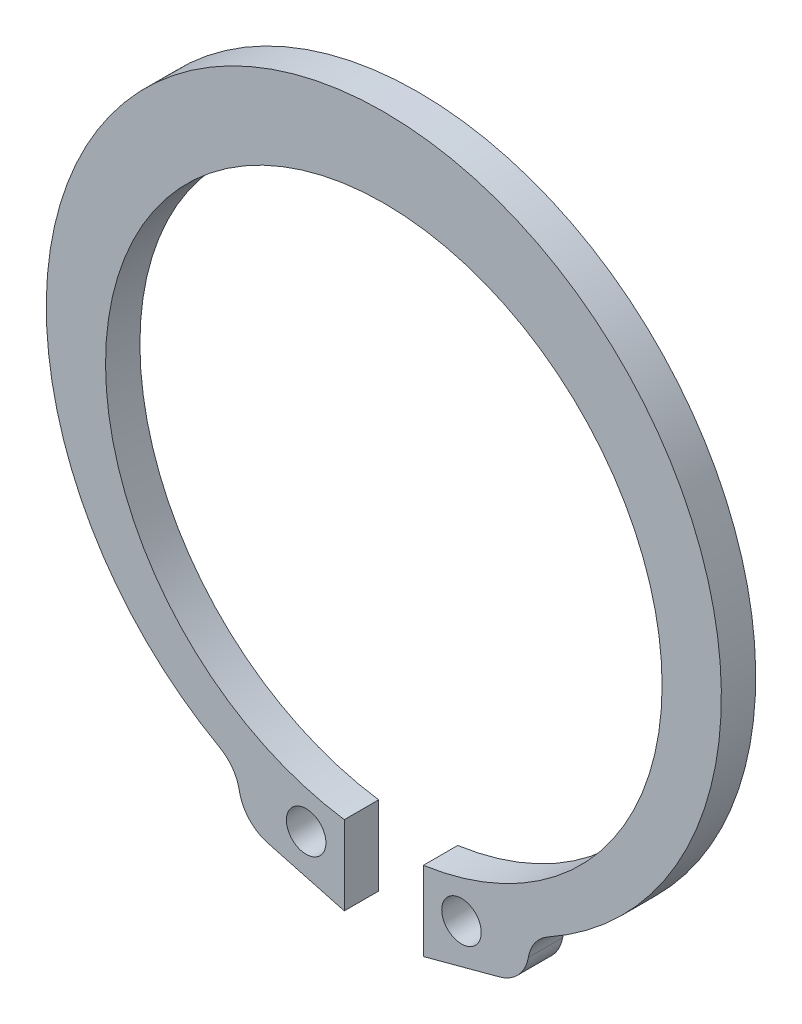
ISO-10303-21;
HEADER;
FILE_DESCRIPTION(('STEP AP214'),'2;1');
FILE_NAME('part.step','',(''),(''),'','','');
FILE_SCHEMA(('AUTOMOTIVE_DESIGN { 1 0 10303 214 1 1 1 1 }'));
ENDSEC;
DATA;
#1=APPLICATION_CONTEXT('core data for automotive mechanical design processes');
#2=APPLICATION_PROTOCOL_DEFINITION('international standard','automotive_design',2000,#1);
#3=PRODUCT_CONTEXT('',#1,'mechanical');
#4=PRODUCT('Part','Part','',(#3));
#5=PRODUCT_RELATED_PRODUCT_CATEGORY('part','',(#4));
#6=PRODUCT_DEFINITION_FORMATION('','',#4);
#7=PRODUCT_DEFINITION_CONTEXT('part definition',#1,'design');
#8=PRODUCT_DEFINITION('design','',#6,#7);
#9=PRODUCT_DEFINITION_SHAPE('','',#8);
#10=(LENGTH_UNIT() NAMED_UNIT(*) SI_UNIT(.MILLI.,.METRE.));
#11=(NAMED_UNIT(*) PLANE_ANGLE_UNIT() SI_UNIT($,.RADIAN.));
#12=(NAMED_UNIT(*) SI_UNIT($,.STERADIAN.) SOLID_ANGLE_UNIT());
#13=UNCERTAINTY_MEASURE_WITH_UNIT(LENGTH_MEASURE(1.E-05),#10,'distance_accuracy_value','');
#14=(GEOMETRIC_REPRESENTATION_CONTEXT(3) GLOBAL_UNCERTAINTY_ASSIGNED_CONTEXT((#13)) GLOBAL_UNIT_ASSIGNED_CONTEXT((#10,
#11,#12)) REPRESENTATION_CONTEXT('',''));
#15=CARTESIAN_POINT('',(0.,0.,0.));
#16=DIRECTION('',(0.,0.,1.));
#17=DIRECTION('',(1.,0.,0.));
#18=AXIS2_PLACEMENT_3D('',#15,#16,#17);
#19=CARTESIAN_POINT('',(-3.07398749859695,-8.61185011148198,1.));
#20=DIRECTION('',(0.,0.,1.));
#21=DIRECTION('',(1.,0.,0.));
#22=AXIS2_PLACEMENT_3D('',#19,#20,#21);
#23=PLANE('',#22);
#24=CARTESIAN_POINT('',(2.26081470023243,-8.87030671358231,1.));
#25=DIRECTION('',(0.,0.,1.));
#26=DIRECTION('',(-1.,0.,0.));
#27=AXIS2_PLACEMENT_3D('',#24,#25,#26);
#28=CIRCLE('',#27,0.575);
#29=CARTESIAN_POINT('',(1.68581470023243,-8.87030671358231,1.));
#30=VERTEX_POINT('',#29);
#31=EDGE_CURVE('E125',#30,#30,#28,.T.);
#32=ORIENTED_EDGE('',*,*,#31,.F.);
#33=EDGE_LOOP('',(#32));
#34=FACE_BOUND('',#33,.T.);
#35=CARTESIAN_POINT('',(-3.07398749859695,-8.61185011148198,1.));
#36=DIRECTION('',(0.,0.,1.));
#37=DIRECTION('',(1.,0.,0.));
#38=AXIS2_PLACEMENT_3D('',#35,#36,#37);
#39=CIRCLE('',#38,1.15);
#40=CARTESIAN_POINT('',(-4.20626452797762,-8.81296880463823,1.));
#41=VERTEX_POINT('',#40);
#42=CARTESIAN_POINT('',(-3.37162940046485,-9.7226648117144,1.));
#43=VERTEX_POINT('',#42);
#44=EDGE_CURVE('E147',#41,#43,#39,.T.);
#45=ORIENTED_EDGE('',*,*,#44,.T.);
#46=DIRECTION('',(0.965925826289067,-0.258819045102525,0.));
#47=VECTOR('',#46,1.);
#48=CARTESIAN_POINT('',(-1.15,-10.3179486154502,1.));
#49=LINE('',#48,#47);
#50=CARTESIAN_POINT('',(-1.15,-10.3179486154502,1.));
#51=VERTEX_POINT('',#50);
#52=EDGE_CURVE('E120',#43,#51,#49,.T.);
#53=ORIENTED_EDGE('',*,*,#52,.T.);
#54=DIRECTION('',(0.,1.,0.));
#55=VECTOR('',#54,1.);
#56=CARTESIAN_POINT('',(-1.15,-8.01794861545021,1.));
#57=LINE('',#56,#55);
#58=CARTESIAN_POINT('',(-1.14999999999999,-8.01794861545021,1.));
#59=VERTEX_POINT('',#58);
#60=EDGE_CURVE('E150',#51,#59,#57,.T.);
#61=ORIENTED_EDGE('',*,*,#60,.T.);
#62=CARTESIAN_POINT('',(0.,0.,1.));
#63=DIRECTION('',(0.,0.,-1.));
#64=DIRECTION('',(1.,0.,0.));
#65=AXIS2_PLACEMENT_3D('',#62,#63,#64);
#66=CIRCLE('',#65,8.1);
#67=CARTESIAN_POINT('',(1.15,-8.01794861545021,1.));
#68=VERTEX_POINT('',#67);
#69=EDGE_CURVE('E152',#59,#68,#66,.T.);
#70=ORIENTED_EDGE('',*,*,#69,.T.);
#71=DIRECTION('',(0.,-1.,0.));
#72=VECTOR('',#71,1.);
#73=CARTESIAN_POINT('',(1.15,-8.01794861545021,1.));
#74=LINE('',#73,#72);
#75=CARTESIAN_POINT('',(1.15,-10.3179486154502,1.));
#76=VERTEX_POINT('',#75);
#77=EDGE_CURVE('E154',#68,#76,#74,.T.);
#78=ORIENTED_EDGE('',*,*,#77,.T.);
#79=DIRECTION('',(0.965925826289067,0.258819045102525,0.));
#80=VECTOR('',#79,1.);
#81=CARTESIAN_POINT('',(1.15,-10.3179486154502,1.));
#82=LINE('',#81,#80);
#83=CARTESIAN_POINT('',(3.37162940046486,-9.7226648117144,1.));
#84=VERTEX_POINT('',#83);
#85=EDGE_CURVE('E156',#76,#84,#82,.T.);
#86=ORIENTED_EDGE('',*,*,#85,.T.);
#87=CARTESIAN_POINT('',(3.07398749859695,-8.61185011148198,1.));
#88=DIRECTION('',(0.,0.,1.));
#89=DIRECTION('',(-1.,0.,0.));
#90=AXIS2_PLACEMENT_3D('',#87,#88,#89);
#91=CIRCLE('',#90,1.15);
#92=CARTESIAN_POINT('',(4.20626452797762,-8.81296880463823,1.));
#93=VERTEX_POINT('',#92);
#94=EDGE_CURVE('E158',#84,#93,#91,.T.);
#95=ORIENTED_EDGE('',*,*,#94,.T.);
#96=CARTESIAN_POINT('',(5.3385415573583,-9.01408749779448,1.));
#97=DIRECTION('',(0.,0.,-1.));
#98=DIRECTION('',(-1.,0.,0.));
#99=AXIS2_PLACEMENT_3D('',#96,#97,#98);
#100=CIRCLE('',#99,1.15);
#101=CARTESIAN_POINT('',(4.77914995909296,-8.00930839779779,1.));
#102=VERTEX_POINT('',#101);
#103=EDGE_CURVE('E160',#93,#102,#100,.T.);
#104=ORIENTED_EDGE('',*,*,#103,.T.);
#105=CARTESIAN_POINT('',(0.,0.575,1.));
#106=DIRECTION('',(0.,0.,1.));
#107=DIRECTION('',(1.,0.,0.));
#108=AXIS2_PLACEMENT_3D('',#105,#106,#107);
#109=CIRCLE('',#108,9.825);
#110=CARTESIAN_POINT('',(-4.77914995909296,-8.00930839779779,1.));
#111=VERTEX_POINT('',#110);
#112=EDGE_CURVE('E49',#102,#111,#109,.T.);
#113=ORIENTED_EDGE('',*,*,#112,.T.);
#114=CARTESIAN_POINT('',(-5.33854155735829,-9.01408749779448,1.));
#115=DIRECTION('',(0.,0.,-1.));
#116=DIRECTION('',(1.,0.,0.));
#117=AXIS2_PLACEMENT_3D('',#114,#115,#116);
#118=CIRCLE('',#117,1.15);
#119=EDGE_CURVE('E44',#111,#41,#118,.T.);
#120=ORIENTED_EDGE('',*,*,#119,.T.);
#121=EDGE_LOOP('',(#45,#53,#61,#70,#78,#86,#95,#104,#113,#120));
#122=FACE_BOUND('',#121,.T.);
#123=CARTESIAN_POINT('',(-2.26081470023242,-8.87030671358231,1.));
#124=DIRECTION('',(0.,0.,1.));
#125=DIRECTION('',(1.,0.,0.));
#126=AXIS2_PLACEMENT_3D('',#123,#124,#125);
#127=CIRCLE('',#126,0.575);
#128=CARTESIAN_POINT('',(-1.68581470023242,-8.87030671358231,1.));
#129=VERTEX_POINT('',#128);
#130=EDGE_CURVE('E247',#129,#129,#127,.T.);
#131=ORIENTED_EDGE('',*,*,#130,.F.);
#132=EDGE_LOOP('',(#131));
#133=FACE_BOUND('',#132,.T.);
#134=ADVANCED_FACE('F29',(#34,#122,#133),#23,.T.);
#135=CARTESIAN_POINT('',(-3.07398749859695,-8.61185011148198,0.));
#136=DIRECTION('',(0.,0.,1.));
#137=DIRECTION('',(1.,0.,0.));
#138=AXIS2_PLACEMENT_3D('',#135,#136,#137);
#139=PLANE('',#138);
#140=CARTESIAN_POINT('',(2.26081470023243,-8.87030671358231,0.));
#141=DIRECTION('',(0.,0.,1.));
#142=DIRECTION('',(-1.,0.,0.));
#143=AXIS2_PLACEMENT_3D('',#140,#141,#142);
#144=CIRCLE('',#143,0.575);
#145=CARTESIAN_POINT('',(1.68581470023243,-8.87030671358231,0.));
#146=VERTEX_POINT('',#145);
#147=EDGE_CURVE('E128',#146,#146,#144,.T.);
#148=ORIENTED_EDGE('',*,*,#147,.T.);
#149=EDGE_LOOP('',(#148));
#150=FACE_BOUND('',#149,.T.);
#151=CARTESIAN_POINT('',(-3.07398749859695,-8.61185011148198,0.));
#152=DIRECTION('',(0.,0.,1.));
#153=DIRECTION('',(1.,0.,0.));
#154=AXIS2_PLACEMENT_3D('',#151,#152,#153);
#155=CIRCLE('',#154,1.15);
#156=CARTESIAN_POINT('',(-4.20626452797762,-8.81296880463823,0.));
#157=VERTEX_POINT('',#156);
#158=CARTESIAN_POINT('',(-3.37162940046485,-9.7226648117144,0.));
#159=VERTEX_POINT('',#158);
#160=EDGE_CURVE('E111',#157,#159,#155,.T.);
#161=ORIENTED_EDGE('',*,*,#160,.F.);
#162=CARTESIAN_POINT('',(-5.33854155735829,-9.01408749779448,0.));
#163=DIRECTION('',(0.,0.,-1.));
#164=DIRECTION('',(1.,0.,0.));
#165=AXIS2_PLACEMENT_3D('',#162,#163,#164);
#166=CIRCLE('',#165,1.15);
#167=CARTESIAN_POINT('',(-4.77914995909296,-8.00930839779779,0.));
#168=VERTEX_POINT('',#167);
#169=EDGE_CURVE('E145',#168,#157,#166,.T.);
#170=ORIENTED_EDGE('',*,*,#169,.F.);
#171=CARTESIAN_POINT('',(0.,0.575,0.));
#172=DIRECTION('',(0.,0.,1.));
#173=DIRECTION('',(1.,0.,0.));
#174=AXIS2_PLACEMENT_3D('',#171,#172,#173);
#175=CIRCLE('',#174,9.825);
#176=CARTESIAN_POINT('',(4.77914995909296,-8.00930839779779,0.));
#177=VERTEX_POINT('',#176);
#178=EDGE_CURVE('E143',#177,#168,#175,.T.);
#179=ORIENTED_EDGE('',*,*,#178,.F.);
#180=CARTESIAN_POINT('',(5.3385415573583,-9.01408749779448,0.));
#181=DIRECTION('',(0.,0.,-1.));
#182=DIRECTION('',(-1.,0.,0.));
#183=AXIS2_PLACEMENT_3D('',#180,#181,#182);
#184=CIRCLE('',#183,1.15);
#185=CARTESIAN_POINT('',(4.20626452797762,-8.81296880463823,0.));
#186=VERTEX_POINT('',#185);
#187=EDGE_CURVE('E141',#186,#177,#184,.T.);
#188=ORIENTED_EDGE('',*,*,#187,.F.);
#189=CARTESIAN_POINT('',(3.07398749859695,-8.61185011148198,0.));
#190=DIRECTION('',(0.,0.,1.));
#191=DIRECTION('',(-1.,0.,0.));
#192=AXIS2_PLACEMENT_3D('',#189,#190,#191);
#193=CIRCLE('',#192,1.15);
#194=CARTESIAN_POINT('',(3.37162940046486,-9.7226648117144,0.));
#195=VERTEX_POINT('',#194);
#196=EDGE_CURVE('E139',#195,#186,#193,.T.);
#197=ORIENTED_EDGE('',*,*,#196,.F.);
#198=DIRECTION('',(0.965925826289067,0.258819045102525,0.));
#199=VECTOR('',#198,1.);
#200=CARTESIAN_POINT('',(1.15,-10.3179486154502,0.));
#201=LINE('',#200,#199);
#202=CARTESIAN_POINT('',(1.15,-10.3179486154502,0.));
#203=VERTEX_POINT('',#202);
#204=EDGE_CURVE('E137',#203,#195,#201,.T.);
#205=ORIENTED_EDGE('',*,*,#204,.F.);
#206=DIRECTION('',(0.,-1.,0.));
#207=VECTOR('',#206,1.);
#208=CARTESIAN_POINT('',(1.15,-8.01794861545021,0.));
#209=LINE('',#208,#207);
#210=CARTESIAN_POINT('',(1.15,-8.01794861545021,0.));
#211=VERTEX_POINT('',#210);
#212=EDGE_CURVE('E135',#211,#203,#209,.T.);
#213=ORIENTED_EDGE('',*,*,#212,.F.);
#214=CARTESIAN_POINT('',(0.,0.,0.));
#215=DIRECTION('',(0.,0.,-1.));
#216=DIRECTION('',(1.,0.,0.));
#217=AXIS2_PLACEMENT_3D('',#214,#215,#216);
#218=CIRCLE('',#217,8.1);
#219=CARTESIAN_POINT('',(-1.14999999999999,-8.01794861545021,0.));
#220=VERTEX_POINT('',#219);
#221=EDGE_CURVE('E133',#220,#211,#218,.T.);
#222=ORIENTED_EDGE('',*,*,#221,.F.);
#223=DIRECTION('',(0.,1.,0.));
#224=VECTOR('',#223,1.);
#225=CARTESIAN_POINT('',(-1.15,-8.01794861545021,0.));
#226=LINE('',#225,#224);
#227=CARTESIAN_POINT('',(-1.15,-10.3179486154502,0.));
#228=VERTEX_POINT('',#227);
#229=EDGE_CURVE('E113',#228,#220,#226,.T.);
#230=ORIENTED_EDGE('',*,*,#229,.F.);
#231=DIRECTION('',(0.965925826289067,-0.258819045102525,0.));
#232=VECTOR('',#231,1.);
#233=CARTESIAN_POINT('',(-1.15,-10.3179486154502,0.));
#234=LINE('',#233,#232);
#235=EDGE_CURVE('E106',#159,#228,#234,.T.);
#236=ORIENTED_EDGE('',*,*,#235,.F.);
#237=EDGE_LOOP('',(#161,#170,#179,#188,#197,#205,#213,#222,#230,#236));
#238=FACE_BOUND('',#237,.T.);
#239=CARTESIAN_POINT('',(-2.26081470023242,-8.87030671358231,0.));
#240=DIRECTION('',(0.,0.,1.));
#241=DIRECTION('',(1.,0.,0.));
#242=AXIS2_PLACEMENT_3D('',#239,#240,#241);
#243=CIRCLE('',#242,0.575);
#244=CARTESIAN_POINT('',(-1.68581470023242,-8.87030671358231,0.));
#245=VERTEX_POINT('',#244);
#246=EDGE_CURVE('E250',#245,#245,#243,.T.);
#247=ORIENTED_EDGE('',*,*,#246,.T.);
#248=EDGE_LOOP('',(#247));
#249=FACE_BOUND('',#248,.T.);
#250=ADVANCED_FACE('F107',(#150,#238,#249),#139,.F.);
#251=CARTESIAN_POINT('',(-3.07398749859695,-8.61185011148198,1.));
#252=DIRECTION('',(0.,0.,-1.));
#253=DIRECTION('',(-1.,0.,0.));
#254=AXIS2_PLACEMENT_3D('',#251,#252,#253);
#255=CYLINDRICAL_SURFACE('',#254,1.15);
#256=ORIENTED_EDGE('',*,*,#160,.T.);
#257=DIRECTION('',(0.,0.,-1.));
#258=VECTOR('',#257,1.);
#259=CARTESIAN_POINT('',(-3.37162940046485,-9.7226648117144,1.));
#260=LINE('',#259,#258);
#261=EDGE_CURVE('E11',#43,#159,#260,.T.);
#262=ORIENTED_EDGE('',*,*,#261,.F.);
#263=ORIENTED_EDGE('',*,*,#44,.F.);
#264=DIRECTION('',(0.,0.,-1.));
#265=VECTOR('',#264,1.);
#266=CARTESIAN_POINT('',(-4.20626452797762,-8.81296880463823,1.));
#267=LINE('',#266,#265);
#268=EDGE_CURVE('E124',#41,#157,#267,.T.);
#269=ORIENTED_EDGE('',*,*,#268,.T.);
#270=EDGE_LOOP('',(#256,#262,#263,#269));
#271=FACE_BOUND('',#270,.T.);
#272=ADVANCED_FACE('F31',(#271),#255,.T.);
#273=CARTESIAN_POINT('',(-1.15,-10.3179486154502,1.));
#274=DIRECTION('',(0.258819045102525,0.965925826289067,0.));
#275=DIRECTION('',(-0.965925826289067,0.258819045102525,0.));
#276=AXIS2_PLACEMENT_3D('',#273,#274,#275);
#277=PLANE('',#276);
#278=ORIENTED_EDGE('',*,*,#235,.T.);
#279=DIRECTION('',(0.,0.,-1.));
#280=VECTOR('',#279,1.);
#281=CARTESIAN_POINT('',(-1.15,-10.3179486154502,1.));
#282=LINE('',#281,#280);
#283=EDGE_CURVE('E37',#51,#228,#282,.T.);
#284=ORIENTED_EDGE('',*,*,#283,.F.);
#285=ORIENTED_EDGE('',*,*,#52,.F.);
#286=ORIENTED_EDGE('',*,*,#261,.T.);
#287=EDGE_LOOP('',(#278,#284,#285,#286));
#288=FACE_BOUND('',#287,.T.);
#289=ADVANCED_FACE('F119',(#288),#277,.F.);
#290=CARTESIAN_POINT('',(-1.15,-8.01794861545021,1.));
#291=DIRECTION('',(-1.,0.,0.));
#292=DIRECTION('',(0.,-1.,0.));
#293=AXIS2_PLACEMENT_3D('',#290,#291,#292);
#294=PLANE('',#293);
#295=ORIENTED_EDGE('',*,*,#229,.T.);
#296=DIRECTION('',(0.,0.,-1.));
#297=VECTOR('',#296,1.);
#298=CARTESIAN_POINT('',(-1.14999999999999,-8.01794861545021,1.));
#299=LINE('',#298,#297);
#300=EDGE_CURVE('E183',#59,#220,#299,.T.);
#301=ORIENTED_EDGE('',*,*,#300,.F.);
#302=ORIENTED_EDGE('',*,*,#60,.F.);
#303=ORIENTED_EDGE('',*,*,#283,.T.);
#304=EDGE_LOOP('',(#295,#301,#302,#303));
#305=FACE_BOUND('',#304,.T.);
#306=ADVANCED_FACE('F187',(#305),#294,.F.);
#307=CARTESIAN_POINT('',(0.,0.,1.));
#308=DIRECTION('',(0.,0.,-1.));
#309=DIRECTION('',(-1.,0.,0.));
#310=AXIS2_PLACEMENT_3D('',#307,#308,#309);
#311=CYLINDRICAL_SURFACE('',#310,8.1);
#312=ORIENTED_EDGE('',*,*,#221,.T.);
#313=DIRECTION('',(0.,0.,-1.));
#314=VECTOR('',#313,1.);
#315=CARTESIAN_POINT('',(1.15,-8.01794861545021,1.));
#316=LINE('',#315,#314);
#317=EDGE_CURVE('E180',#68,#211,#316,.T.);
#318=ORIENTED_EDGE('',*,*,#317,.F.);
#319=ORIENTED_EDGE('',*,*,#69,.F.);
#320=ORIENTED_EDGE('',*,*,#300,.T.);
#321=EDGE_LOOP('',(#312,#318,#319,#320));
#322=FACE_BOUND('',#321,.T.);
#323=ADVANCED_FACE('F195',(#322),#311,.F.);
#324=CARTESIAN_POINT('',(1.15,-8.01794861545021,1.));
#325=DIRECTION('',(1.,0.,0.));
#326=DIRECTION('',(0.,1.,0.));
#327=AXIS2_PLACEMENT_3D('',#324,#325,#326);
#328=PLANE('',#327);
#329=ORIENTED_EDGE('',*,*,#212,.T.);
#330=DIRECTION('',(0.,0.,-1.));
#331=VECTOR('',#330,1.);
#332=CARTESIAN_POINT('',(1.15,-10.3179486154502,1.));
#333=LINE('',#332,#331);
#334=EDGE_CURVE('E177',#76,#203,#333,.T.);
#335=ORIENTED_EDGE('',*,*,#334,.F.);
#336=ORIENTED_EDGE('',*,*,#77,.F.);
#337=ORIENTED_EDGE('',*,*,#317,.T.);
#338=EDGE_LOOP('',(#329,#335,#336,#337));
#339=FACE_BOUND('',#338,.T.);
#340=ADVANCED_FACE('F198',(#339),#328,.F.);
#341=CARTESIAN_POINT('',(1.15,-10.3179486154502,1.));
#342=DIRECTION('',(-0.258819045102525,0.965925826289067,0.));
#343=DIRECTION('',(-0.965925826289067,-0.258819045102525,0.));
#344=AXIS2_PLACEMENT_3D('',#341,#342,#343);
#345=PLANE('',#344);
#346=ORIENTED_EDGE('',*,*,#204,.T.);
#347=DIRECTION('',(0.,0.,-1.));
#348=VECTOR('',#347,1.);
#349=CARTESIAN_POINT('',(3.37162940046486,-9.7226648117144,1.));
#350=LINE('',#349,#348);
#351=EDGE_CURVE('E174',#84,#195,#350,.T.);
#352=ORIENTED_EDGE('',*,*,#351,.F.);
#353=ORIENTED_EDGE('',*,*,#85,.F.);
#354=ORIENTED_EDGE('',*,*,#334,.T.);
#355=EDGE_LOOP('',(#346,#352,#353,#354));
#356=FACE_BOUND('',#355,.T.);
#357=ADVANCED_FACE('F203',(#356),#345,.F.);
#358=CARTESIAN_POINT('',(3.07398749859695,-8.61185011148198,1.));
#359=DIRECTION('',(0.,0.,-1.));
#360=DIRECTION('',(-1.,0.,0.));
#361=AXIS2_PLACEMENT_3D('',#358,#359,#360);
#362=CYLINDRICAL_SURFACE('',#361,1.15);
#363=ORIENTED_EDGE('',*,*,#196,.T.);
#364=DIRECTION('',(0.,0.,-1.));
#365=VECTOR('',#364,1.);
#366=CARTESIAN_POINT('',(4.20626452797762,-8.81296880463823,1.));
#367=LINE('',#366,#365);
#368=EDGE_CURVE('E171',#93,#186,#367,.T.);
#369=ORIENTED_EDGE('',*,*,#368,.F.);
#370=ORIENTED_EDGE('',*,*,#94,.F.);
#371=ORIENTED_EDGE('',*,*,#351,.T.);
#372=EDGE_LOOP('',(#363,#369,#370,#371));
#373=FACE_BOUND('',#372,.T.);
#374=ADVANCED_FACE('F209',(#373),#362,.T.);
#375=CARTESIAN_POINT('',(5.3385415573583,-9.01408749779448,1.));
#376=DIRECTION('',(0.,0.,-1.));
#377=DIRECTION('',(-1.,0.,0.));
#378=AXIS2_PLACEMENT_3D('',#375,#376,#377);
#379=CYLINDRICAL_SURFACE('',#378,1.15);
#380=ORIENTED_EDGE('',*,*,#187,.T.);
#381=DIRECTION('',(0.,0.,-1.));
#382=VECTOR('',#381,1.);
#383=CARTESIAN_POINT('',(4.77914995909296,-8.00930839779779,1.));
#384=LINE('',#383,#382);
#385=EDGE_CURVE('E168',#102,#177,#384,.T.);
#386=ORIENTED_EDGE('',*,*,#385,.F.);
#387=ORIENTED_EDGE('',*,*,#103,.F.);
#388=ORIENTED_EDGE('',*,*,#368,.T.);
#389=EDGE_LOOP('',(#380,#386,#387,#388));
#390=FACE_BOUND('',#389,.T.);
#391=ADVANCED_FACE('F213',(#390),#379,.F.);
#392=CARTESIAN_POINT('',(0.,0.575,1.));
#393=DIRECTION('',(0.,0.,-1.));
#394=DIRECTION('',(-1.,0.,0.));
#395=AXIS2_PLACEMENT_3D('',#392,#393,#394);
#396=CYLINDRICAL_SURFACE('',#395,9.825);
#397=ORIENTED_EDGE('',*,*,#178,.T.);
#398=DIRECTION('',(0.,0.,-1.));
#399=VECTOR('',#398,1.);
#400=CARTESIAN_POINT('',(-4.77914995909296,-8.00930839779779,1.));
#401=LINE('',#400,#399);
#402=EDGE_CURVE('E165',#111,#168,#401,.T.);
#403=ORIENTED_EDGE('',*,*,#402,.F.);
#404=ORIENTED_EDGE('',*,*,#112,.F.);
#405=ORIENTED_EDGE('',*,*,#385,.T.);
#406=EDGE_LOOP('',(#397,#403,#404,#405));
#407=FACE_BOUND('',#406,.T.);
#408=ADVANCED_FACE('F216',(#407),#396,.T.);
#409=CARTESIAN_POINT('',(-5.33854155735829,-9.01408749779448,1.));
#410=DIRECTION('',(0.,0.,-1.));
#411=DIRECTION('',(-1.,0.,0.));
#412=AXIS2_PLACEMENT_3D('',#409,#410,#411);
#413=CYLINDRICAL_SURFACE('',#412,1.15);
#414=ORIENTED_EDGE('',*,*,#169,.T.);
#415=ORIENTED_EDGE('',*,*,#268,.F.);
#416=ORIENTED_EDGE('',*,*,#119,.F.);
#417=ORIENTED_EDGE('',*,*,#402,.T.);
#418=EDGE_LOOP('',(#414,#415,#416,#417));
#419=FACE_BOUND('',#418,.T.);
#420=ADVANCED_FACE('F218',(#419),#413,.F.);
#421=CARTESIAN_POINT('',(2.26081470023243,-8.87030671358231,1.));
#422=DIRECTION('',(0.,0.,-1.));
#423=DIRECTION('',(-1.,0.,0.));
#424=AXIS2_PLACEMENT_3D('',#421,#422,#423);
#425=CYLINDRICAL_SURFACE('',#424,0.575);
#426=ORIENTED_EDGE('',*,*,#31,.T.);
#427=EDGE_LOOP('',(#426));
#428=FACE_BOUND('',#427,.T.);
#429=ORIENTED_EDGE('',*,*,#147,.F.);
#430=EDGE_LOOP('',(#429));
#431=FACE_BOUND('',#430,.T.);
#432=ADVANCED_FACE('F220',(#428,#431),#425,.F.);
#433=CARTESIAN_POINT('',(-2.26081470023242,-8.87030671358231,1.));
#434=DIRECTION('',(0.,0.,-1.));
#435=DIRECTION('',(-1.,0.,0.));
#436=AXIS2_PLACEMENT_3D('',#433,#434,#435);
#437=CYLINDRICAL_SURFACE('',#436,0.575);
#438=ORIENTED_EDGE('',*,*,#130,.T.);
#439=EDGE_LOOP('',(#438));
#440=FACE_BOUND('',#439,.T.);
#441=ORIENTED_EDGE('',*,*,#246,.F.);
#442=EDGE_LOOP('',(#441));
#443=FACE_BOUND('',#442,.T.);
#444=ADVANCED_FACE('F226',(#440,#443),#437,.F.);
#445=CLOSED_SHELL('',(#134,#250,#272,#289,#306,#323,#340,#357,#374,#391,#408,#420,#432,#444));
#446=MANIFOLD_SOLID_BREP('B2',#445);
#447=ADVANCED_BREP_SHAPE_REPRESENTATION('',(#18,#446),#14);
#448=SHAPE_DEFINITION_REPRESENTATION(#9,#447);
ENDSEC;
END-ISO-10303-21;
